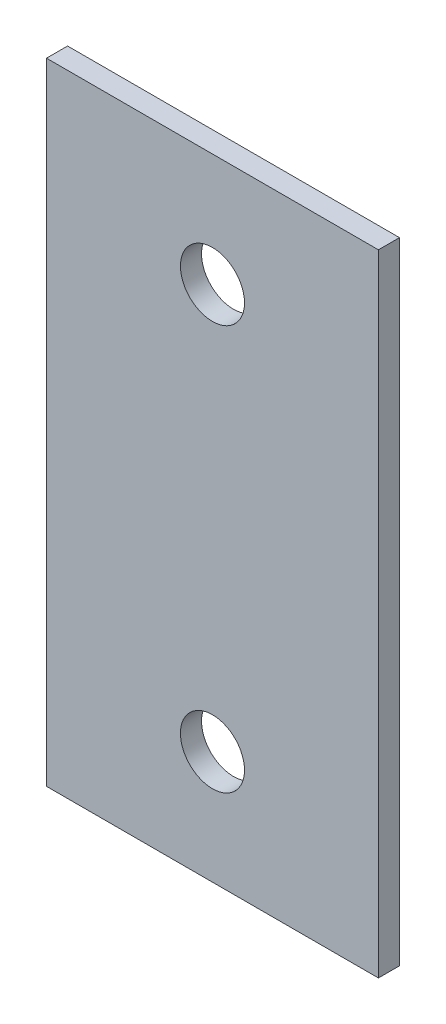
ISO-10303-21;
HEADER;
FILE_DESCRIPTION(('STEP AP214'),'2;1');
FILE_NAME('part.step','',(''),(''),'','','');
FILE_SCHEMA(('AUTOMOTIVE_DESIGN { 1 0 10303 214 1 1 1 1 }'));
ENDSEC;
DATA;
#1=APPLICATION_CONTEXT('core data for automotive mechanical design processes');
#2=APPLICATION_PROTOCOL_DEFINITION('international standard','automotive_design',2000,#1);
#3=PRODUCT_CONTEXT('',#1,'mechanical');
#4=PRODUCT('Part','Part','',(#3));
#5=PRODUCT_RELATED_PRODUCT_CATEGORY('part','',(#4));
#6=PRODUCT_DEFINITION_FORMATION('','',#4);
#7=PRODUCT_DEFINITION_CONTEXT('part definition',#1,'design');
#8=PRODUCT_DEFINITION('design','',#6,#7);
#9=PRODUCT_DEFINITION_SHAPE('','',#8);
#10=(LENGTH_UNIT() NAMED_UNIT(*) SI_UNIT(.MILLI.,.METRE.));
#11=(NAMED_UNIT(*) PLANE_ANGLE_UNIT() SI_UNIT($,.RADIAN.));
#12=(NAMED_UNIT(*) SI_UNIT($,.STERADIAN.) SOLID_ANGLE_UNIT());
#13=UNCERTAINTY_MEASURE_WITH_UNIT(LENGTH_MEASURE(1.E-05),#10,'distance_accuracy_value','');
#14=(GEOMETRIC_REPRESENTATION_CONTEXT(3) GLOBAL_UNCERTAINTY_ASSIGNED_CONTEXT((#13)) GLOBAL_UNIT_ASSIGNED_CONTEXT((#10,
#11,#12)) REPRESENTATION_CONTEXT('',''));
#15=CARTESIAN_POINT('',(0.,0.,0.));
#16=DIRECTION('',(0.,0.,1.));
#17=DIRECTION('',(1.,0.,0.));
#18=AXIS2_PLACEMENT_3D('',#15,#16,#17);
#19=CARTESIAN_POINT('',(-25.,47.5,1.5875));
#20=DIRECTION('',(0.,-1.,0.));
#21=DIRECTION('',(1.,0.,0.));
#22=AXIS2_PLACEMENT_3D('',#19,#20,#21);
#23=PLANE('',#22);
#24=DIRECTION('',(-1.,0.,0.));
#25=VECTOR('',#24,1.);
#26=CARTESIAN_POINT('',(-25.,47.5,-1.5875));
#27=LINE('',#26,#25);
#28=CARTESIAN_POINT('',(25.,47.5,-1.5875));
#29=VERTEX_POINT('',#28);
#30=CARTESIAN_POINT('',(-25.,47.5,-1.5875));
#31=VERTEX_POINT('',#30);
#32=EDGE_CURVE('E114',#29,#31,#27,.T.);
#33=ORIENTED_EDGE('',*,*,#32,.T.);
#34=DIRECTION('',(0.,0.,-1.));
#35=VECTOR('',#34,1.);
#36=CARTESIAN_POINT('',(-25.,47.5,1.5875));
#37=LINE('',#36,#35);
#38=CARTESIAN_POINT('',(-25.,47.5,1.5875));
#39=VERTEX_POINT('',#38);
#40=EDGE_CURVE('E11',#39,#31,#37,.T.);
#41=ORIENTED_EDGE('',*,*,#40,.F.);
#42=DIRECTION('',(-1.,0.,0.));
#43=VECTOR('',#42,1.);
#44=CARTESIAN_POINT('',(-25.,47.5,1.5875));
#45=LINE('',#44,#43);
#46=CARTESIAN_POINT('',(25.,47.5,1.5875));
#47=VERTEX_POINT('',#46);
#48=EDGE_CURVE('E100',#47,#39,#45,.T.);
#49=ORIENTED_EDGE('',*,*,#48,.F.);
#50=DIRECTION('',(0.,0.,-1.));
#51=VECTOR('',#50,1.);
#52=CARTESIAN_POINT('',(25.,47.5,1.5875));
#53=LINE('',#52,#51);
#54=EDGE_CURVE('E108',#47,#29,#53,.T.);
#55=ORIENTED_EDGE('',*,*,#54,.T.);
#56=EDGE_LOOP('',(#33,#41,#49,#55));
#57=FACE_BOUND('',#56,.T.);
#58=ADVANCED_FACE('F44',(#57),#23,.F.);
#59=CARTESIAN_POINT('',(-25.,-47.5,1.5875));
#60=DIRECTION('',(1.,0.,0.));
#61=DIRECTION('',(0.,0.,-1.));
#62=AXIS2_PLACEMENT_3D('',#59,#60,#61);
#63=PLANE('',#62);
#64=DIRECTION('',(0.,-1.,0.));
#65=VECTOR('',#64,1.);
#66=CARTESIAN_POINT('',(-25.,-47.5,-1.5875));
#67=LINE('',#66,#65);
#68=CARTESIAN_POINT('',(-25.,-47.5,-1.5875));
#69=VERTEX_POINT('',#68);
#70=EDGE_CURVE('E105',#31,#69,#67,.T.);
#71=ORIENTED_EDGE('',*,*,#70,.T.);
#72=DIRECTION('',(0.,0.,-1.));
#73=VECTOR('',#72,1.);
#74=CARTESIAN_POINT('',(-25.,-47.5,1.5875));
#75=LINE('',#74,#73);
#76=CARTESIAN_POINT('',(-25.,-47.5,1.5875));
#77=VERTEX_POINT('',#76);
#78=EDGE_CURVE('E53',#77,#69,#75,.T.);
#79=ORIENTED_EDGE('',*,*,#78,.F.);
#80=DIRECTION('',(0.,-1.,0.));
#81=VECTOR('',#80,1.);
#82=CARTESIAN_POINT('',(-25.,-47.5,1.5875));
#83=LINE('',#82,#81);
#84=EDGE_CURVE('E95',#39,#77,#83,.T.);
#85=ORIENTED_EDGE('',*,*,#84,.F.);
#86=ORIENTED_EDGE('',*,*,#40,.T.);
#87=EDGE_LOOP('',(#71,#79,#85,#86));
#88=FACE_BOUND('',#87,.T.);
#89=ADVANCED_FACE('F101',(#88),#63,.F.);
#90=CARTESIAN_POINT('',(-25.,-47.5,1.5875));
#91=DIRECTION('',(0.,1.,0.));
#92=DIRECTION('',(-1.,0.,0.));
#93=AXIS2_PLACEMENT_3D('',#90,#91,#92);
#94=PLANE('',#93);
#95=DIRECTION('',(1.,0.,0.));
#96=VECTOR('',#95,1.);
#97=CARTESIAN_POINT('',(-25.,-47.5,-1.5875));
#98=LINE('',#97,#96);
#99=CARTESIAN_POINT('',(25.,-47.5,-1.5875));
#100=VERTEX_POINT('',#99);
#101=EDGE_CURVE('E78',#69,#100,#98,.T.);
#102=ORIENTED_EDGE('',*,*,#101,.T.);
#103=DIRECTION('',(0.,0.,-1.));
#104=VECTOR('',#103,1.);
#105=CARTESIAN_POINT('',(25.,-47.5,1.5875));
#106=LINE('',#105,#104);
#107=CARTESIAN_POINT('',(25.,-47.5,1.5875));
#108=VERTEX_POINT('',#107);
#109=EDGE_CURVE('E102',#108,#100,#106,.T.);
#110=ORIENTED_EDGE('',*,*,#109,.F.);
#111=DIRECTION('',(1.,0.,0.));
#112=VECTOR('',#111,1.);
#113=CARTESIAN_POINT('',(-25.,-47.5,1.5875));
#114=LINE('',#113,#112);
#115=EDGE_CURVE('E92',#77,#108,#114,.T.);
#116=ORIENTED_EDGE('',*,*,#115,.F.);
#117=ORIENTED_EDGE('',*,*,#78,.T.);
#118=EDGE_LOOP('',(#102,#110,#116,#117));
#119=FACE_BOUND('',#118,.T.);
#120=ADVANCED_FACE('F104',(#119),#94,.F.);
#121=CARTESIAN_POINT('',(25.,-47.5,1.5875));
#122=DIRECTION('',(-1.,0.,0.));
#123=DIRECTION('',(0.,0.,1.));
#124=AXIS2_PLACEMENT_3D('',#121,#122,#123);
#125=PLANE('',#124);
#126=DIRECTION('',(0.,1.,0.));
#127=VECTOR('',#126,1.);
#128=CARTESIAN_POINT('',(25.,-47.5,-1.5875));
#129=LINE('',#128,#127);
#130=EDGE_CURVE('E82',#100,#29,#129,.T.);
#131=ORIENTED_EDGE('',*,*,#130,.T.);
#132=ORIENTED_EDGE('',*,*,#54,.F.);
#133=DIRECTION('',(0.,1.,0.));
#134=VECTOR('',#133,1.);
#135=CARTESIAN_POINT('',(25.,-47.5,1.5875));
#136=LINE('',#135,#134);
#137=EDGE_CURVE('E61',#108,#47,#136,.T.);
#138=ORIENTED_EDGE('',*,*,#137,.F.);
#139=ORIENTED_EDGE('',*,*,#109,.T.);
#140=EDGE_LOOP('',(#131,#132,#138,#139));
#141=FACE_BOUND('',#140,.T.);
#142=ADVANCED_FACE('F130',(#141),#125,.F.);
#143=CARTESIAN_POINT('',(0.,0.,1.5875));
#144=DIRECTION('',(0.,0.,1.));
#145=DIRECTION('',(1.,0.,0.));
#146=AXIS2_PLACEMENT_3D('',#143,#144,#145);
#147=PLANE('',#146);
#148=CARTESIAN_POINT('',(0.,-30.48,1.5875));
#149=DIRECTION('',(0.,0.,1.));
#150=DIRECTION('',(1.,0.,0.));
#151=AXIS2_PLACEMENT_3D('',#148,#149,#150);
#152=CIRCLE('',#151,4.826);
#153=CARTESIAN_POINT('',(4.826,-30.48,1.5875));
#154=VERTEX_POINT('',#153);
#155=EDGE_CURVE('E140',#154,#154,#152,.T.);
#156=ORIENTED_EDGE('',*,*,#155,.F.);
#157=EDGE_LOOP('',(#156));
#158=FACE_BOUND('',#157,.T.);
#159=CARTESIAN_POINT('',(0.,30.48,1.5875));
#160=DIRECTION('',(0.,0.,1.));
#161=DIRECTION('',(1.,0.,0.));
#162=AXIS2_PLACEMENT_3D('',#159,#160,#161);
#163=CIRCLE('',#162,4.826);
#164=CARTESIAN_POINT('',(4.82599999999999,30.48,1.5875));
#165=VERTEX_POINT('',#164);
#166=EDGE_CURVE('E133',#165,#165,#163,.T.);
#167=ORIENTED_EDGE('',*,*,#166,.F.);
#168=EDGE_LOOP('',(#167));
#169=FACE_BOUND('',#168,.T.);
#170=ORIENTED_EDGE('',*,*,#48,.T.);
#171=ORIENTED_EDGE('',*,*,#84,.T.);
#172=ORIENTED_EDGE('',*,*,#115,.T.);
#173=ORIENTED_EDGE('',*,*,#137,.T.);
#174=EDGE_LOOP('',(#170,#171,#172,#173));
#175=FACE_BOUND('',#174,.T.);
#176=ADVANCED_FACE('F91',(#158,#169,#175),#147,.T.);
#177=CARTESIAN_POINT('',(0.,0.,-1.5875));
#178=DIRECTION('',(0.,0.,1.));
#179=DIRECTION('',(1.,0.,0.));
#180=AXIS2_PLACEMENT_3D('',#177,#178,#179);
#181=PLANE('',#180);
#182=CARTESIAN_POINT('',(0.,-30.48,-1.5875));
#183=DIRECTION('',(0.,0.,1.));
#184=DIRECTION('',(1.,0.,0.));
#185=AXIS2_PLACEMENT_3D('',#182,#183,#184);
#186=CIRCLE('',#185,4.826);
#187=CARTESIAN_POINT('',(4.826,-30.48,-1.5875));
#188=VERTEX_POINT('',#187);
#189=EDGE_CURVE('E116',#188,#188,#186,.T.);
#190=ORIENTED_EDGE('',*,*,#189,.T.);
#191=EDGE_LOOP('',(#190));
#192=FACE_BOUND('',#191,.T.);
#193=CARTESIAN_POINT('',(0.,30.48,-1.5875));
#194=DIRECTION('',(0.,0.,1.));
#195=DIRECTION('',(1.,0.,0.));
#196=AXIS2_PLACEMENT_3D('',#193,#194,#195);
#197=CIRCLE('',#196,4.826);
#198=CARTESIAN_POINT('',(4.82599999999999,30.48,-1.5875));
#199=VERTEX_POINT('',#198);
#200=EDGE_CURVE('E138',#199,#199,#197,.T.);
#201=ORIENTED_EDGE('',*,*,#200,.T.);
#202=EDGE_LOOP('',(#201));
#203=FACE_BOUND('',#202,.T.);
#204=ORIENTED_EDGE('',*,*,#32,.F.);
#205=ORIENTED_EDGE('',*,*,#130,.F.);
#206=ORIENTED_EDGE('',*,*,#101,.F.);
#207=ORIENTED_EDGE('',*,*,#70,.F.);
#208=EDGE_LOOP('',(#204,#205,#206,#207));
#209=FACE_BOUND('',#208,.T.);
#210=ADVANCED_FACE('F128',(#192,#203,#209),#181,.F.);
#211=CARTESIAN_POINT('',(0.,30.48,-1.5875));
#212=DIRECTION('',(0.,0.,1.));
#213=DIRECTION('',(1.,0.,0.));
#214=AXIS2_PLACEMENT_3D('',#211,#212,#213);
#215=CYLINDRICAL_SURFACE('',#214,4.826);
#216=ORIENTED_EDGE('',*,*,#200,.F.);
#217=EDGE_LOOP('',(#216));
#218=FACE_BOUND('',#217,.T.);
#219=ORIENTED_EDGE('',*,*,#166,.T.);
#220=EDGE_LOOP('',(#219));
#221=FACE_BOUND('',#220,.T.);
#222=ADVANCED_FACE('F160',(#218,#221),#215,.F.);
#223=CARTESIAN_POINT('',(0.,-30.48,-1.5875));
#224=DIRECTION('',(0.,0.,1.));
#225=DIRECTION('',(1.,0.,0.));
#226=AXIS2_PLACEMENT_3D('',#223,#224,#225);
#227=CYLINDRICAL_SURFACE('',#226,4.826);
#228=ORIENTED_EDGE('',*,*,#189,.F.);
#229=EDGE_LOOP('',(#228));
#230=FACE_BOUND('',#229,.T.);
#231=ORIENTED_EDGE('',*,*,#155,.T.);
#232=EDGE_LOOP('',(#231));
#233=FACE_BOUND('',#232,.T.);
#234=ADVANCED_FACE('F147',(#230,#233),#227,.F.);
#235=CLOSED_SHELL('',(#58,#89,#120,#142,#176,#210,#222,#234));
#236=MANIFOLD_SOLID_BREP('B2',#235);
#237=ADVANCED_BREP_SHAPE_REPRESENTATION('',(#18,#236),#14);
#238=SHAPE_DEFINITION_REPRESENTATION(#9,#237);
ENDSEC;
END-ISO-10303-21;
